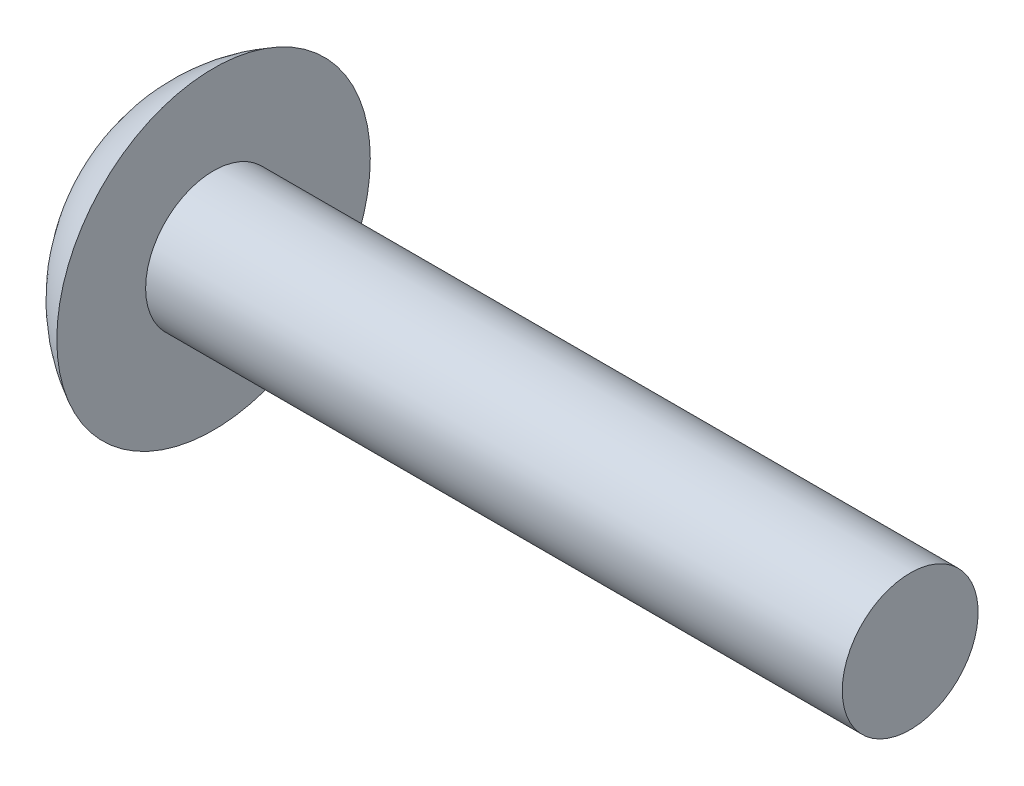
from build123d import *

# Parameters (mm, degrees)
ENL_V_MAT_EXTRU_1_DEPTH = 7


with BuildPart() as part:
    # Esquisse1 → Base-R_volution (revolve)
    with BuildSketch(Plane.XY, mode=Mode.PRIVATE) as base_r_volution_sk:
        with BuildLine():
            Line((49, 0), (49, 3.9))
            Line((49, 3.9), (9, 3.9))
            Line((9, 3.9), (9, 9))
            ThreePointArc((9, 9), (5.13750963, 5.256939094), (4, 0))
            Line((4, 0), (49, 0))
        make_face()
    revolve(base_r_volution_sk.sketch.rotate(Axis((-40, 0, 0), (1, 0, 0)), 90), axis=Axis((-40, 0, 0), (1, 0, 0)))

    # Esquisse2 → Enl_v. mat.-Extru.1 (cut)
    with BuildSketch(Plane(origin=(0, 0, 0), x_dir=(0, 0, -1), z_dir=(1, 0, 0))):
        Polygon((-1.346861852, 2.5), (1.545084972, 2.5), (2.838402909, -0.086635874), (1.2449695, -2.5), (-1.646977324, -2.5), (-2.940295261, 0.086635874), align=None)
    extrude(amount=ENL_V_MAT_EXTRU_1_DEPTH, mode=Mode.SUBTRACT)


solid = part.part
